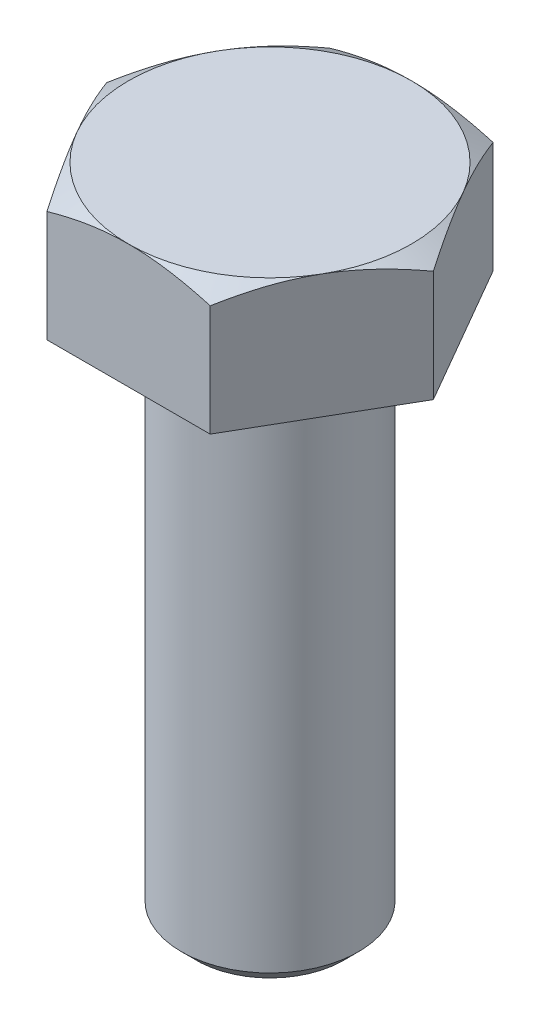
ISO-10303-21;
HEADER;
FILE_DESCRIPTION(('STEP AP214'),'2;1');
FILE_NAME('part.step','',(''),(''),'','','');
FILE_SCHEMA(('AUTOMOTIVE_DESIGN { 1 0 10303 214 1 1 1 1 }'));
ENDSEC;
DATA;
#1=APPLICATION_CONTEXT('core data for automotive mechanical design processes');
#2=APPLICATION_PROTOCOL_DEFINITION('international standard','automotive_design',2000,#1);
#3=PRODUCT_CONTEXT('',#1,'mechanical');
#4=PRODUCT('Part','Part','',(#3));
#5=PRODUCT_RELATED_PRODUCT_CATEGORY('part','',(#4));
#6=PRODUCT_DEFINITION_FORMATION('','',#4);
#7=PRODUCT_DEFINITION_CONTEXT('part definition',#1,'design');
#8=PRODUCT_DEFINITION('design','',#6,#7);
#9=PRODUCT_DEFINITION_SHAPE('','',#8);
#10=(LENGTH_UNIT() NAMED_UNIT(*) SI_UNIT(.MILLI.,.METRE.));
#11=(NAMED_UNIT(*) PLANE_ANGLE_UNIT() SI_UNIT($,.RADIAN.));
#12=(NAMED_UNIT(*) SI_UNIT($,.STERADIAN.) SOLID_ANGLE_UNIT());
#13=UNCERTAINTY_MEASURE_WITH_UNIT(LENGTH_MEASURE(1.E-05),#10,'distance_accuracy_value','');
#14=(GEOMETRIC_REPRESENTATION_CONTEXT(3) GLOBAL_UNCERTAINTY_ASSIGNED_CONTEXT((#13)) GLOBAL_UNIT_ASSIGNED_CONTEXT((#10,
#11,#12)) REPRESENTATION_CONTEXT('',''));
#15=CARTESIAN_POINT('',(0.,0.,0.));
#16=DIRECTION('',(0.,0.,1.));
#17=DIRECTION('',(1.,0.,0.));
#18=AXIS2_PLACEMENT_3D('',#15,#16,#17);
#19=CARTESIAN_POINT('',(0.,-18.,0.));
#20=DIRECTION('',(0.,1.,0.));
#21=DIRECTION('',(0.,0.,1.));
#22=AXIS2_PLACEMENT_3D('',#19,#20,#21);
#23=CYLINDRICAL_SURFACE('',#22,3.);
#24=CARTESIAN_POINT('',(0.,0.,0.));
#25=DIRECTION('',(0.,1.,0.));
#26=DIRECTION('',(0.,0.,1.));
#27=AXIS2_PLACEMENT_3D('',#24,#25,#26);
#28=CIRCLE('',#27,3.);
#29=CARTESIAN_POINT('',(0.,0.,3.));
#30=VERTEX_POINT('',#29);
#31=EDGE_CURVE('E13',#30,#30,#28,.F.);
#32=ORIENTED_EDGE('',*,*,#31,.T.);
#33=EDGE_LOOP('',(#32));
#34=FACE_BOUND('',#33,.T.);
#35=CARTESIAN_POINT('',(0.,-17.5,0.));
#36=DIRECTION('',(0.,1.,0.));
#37=DIRECTION('',(0.,0.,1.));
#38=AXIS2_PLACEMENT_3D('',#35,#36,#37);
#39=CIRCLE('',#38,3.);
#40=CARTESIAN_POINT('',(0.,-17.5,3.));
#41=VERTEX_POINT('',#40);
#42=EDGE_CURVE('E157',#41,#41,#39,.F.);
#43=ORIENTED_EDGE('',*,*,#42,.F.);
#44=EDGE_LOOP('',(#43));
#45=FACE_BOUND('',#44,.T.);
#46=ADVANCED_FACE('F62',(#34,#45),#23,.T.);
#47=CARTESIAN_POINT('',(2.7712812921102,4.2,4.8));
#48=DIRECTION('',(-0.866025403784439,0.,-0.5));
#49=DIRECTION('',(-0.5,0.,0.866025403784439));
#50=AXIS2_PLACEMENT_3D('',#47,#48,#49);
#51=PLANE('',#50);
#52=CARTESIAN_POINT('',(2.77116582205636,3.77121462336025,4.8002));
#53=CARTESIAN_POINT('',(2.89295517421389,3.84154644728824,4.58925465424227));
#54=CARTESIAN_POINT('',(3.01578619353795,3.90551651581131,4.37650508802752));
#55=CARTESIAN_POINT('',(3.26357516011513,4.01717683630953,3.94732200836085));
#56=CARTESIAN_POINT('',(3.38853750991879,4.06482758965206,3.73088086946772));
#57=CARTESIAN_POINT('',(3.63693257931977,4.13899002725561,3.30064798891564));
#58=CARTESIAN_POINT('',(3.76032661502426,4.1659956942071,3.08692324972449));
#59=CARTESIAN_POINT('',(3.94585172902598,4.19021248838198,2.7655843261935));
#60=CARTESIAN_POINT('',(4.00773575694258,4.19557080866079,2.65839804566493));
#61=CARTESIAN_POINT('',(4.13156100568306,4.20076582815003,2.44392642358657));
#62=CARTESIAN_POINT('',(4.19350222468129,4.20060269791,2.33664108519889));
#63=CARTESIAN_POINT('',(4.36320446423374,4.19255683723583,2.04270818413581));
#64=CARTESIAN_POINT('',(4.4709092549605,4.17904378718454,1.8561580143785));
#65=CARTESIAN_POINT('',(4.68560400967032,4.13619360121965,1.48429579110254));
#66=CARTESIAN_POINT('',(4.79259321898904,4.10684181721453,1.29898504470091));
#67=CARTESIAN_POINT('',(5.00772054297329,4.03346981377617,0.926373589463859));
#68=CARTESIAN_POINT('',(5.11583150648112,3.98913868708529,0.73911990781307));
#69=CARTESIAN_POINT('',(5.33044109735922,3.88852463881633,0.367405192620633));
#70=CARTESIAN_POINT('',(5.43694247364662,3.83226535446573,0.182939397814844));
#71=CARTESIAN_POINT('',(5.54267805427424,3.77121462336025,-0.000199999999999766));
#72=B_SPLINE_CURVE_WITH_KNOTS('',3,(#52,#53,#54,#55,#56,#57,#58,#59,#60,#61,#62,#63,#64,#65,#66,
#67,#68,#69,#70,#71),.UNSPECIFIED.,.F.,.F.,(4,2,2,2,2,2,2,2,2,4),(0.,0.760854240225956,
1.52353721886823,2.26734461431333,2.63888926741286,3.01042244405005,3.65724518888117,
4.30466716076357,4.96644900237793,5.62693149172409),.UNSPECIFIED.);
#73=CARTESIAN_POINT('',(2.7712812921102,3.7712812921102,4.8));
#74=VERTEX_POINT('',#73);
#75=CARTESIAN_POINT('',(4.1569219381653,4.2,2.4));
#76=VERTEX_POINT('',#75);
#77=EDGE_CURVE('E137',#74,#76,#72,.T.);
#78=ORIENTED_EDGE('',*,*,#77,.F.);
#79=DIRECTION('',(0.,-1.,0.));
#80=VECTOR('',#79,1.);
#81=CARTESIAN_POINT('',(2.7712812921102,4.2,4.8));
#82=LINE('',#81,#80);
#83=CARTESIAN_POINT('',(2.7712812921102,0.,4.8));
#84=VERTEX_POINT('',#83);
#85=EDGE_CURVE('E86',#74,#84,#82,.T.);
#86=ORIENTED_EDGE('',*,*,#85,.T.);
#87=DIRECTION('',(0.5,0.,-0.866025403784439));
#88=VECTOR('',#87,1.);
#89=CARTESIAN_POINT('',(2.7712812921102,0.,4.8));
#90=LINE('',#89,#88);
#91=CARTESIAN_POINT('',(5.5425625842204,0.,0.));
#92=VERTEX_POINT('',#91);
#93=EDGE_CURVE('E144',#84,#92,#90,.T.);
#94=ORIENTED_EDGE('',*,*,#93,.T.);
#95=DIRECTION('',(0.,-1.,0.));
#96=VECTOR('',#95,1.);
#97=CARTESIAN_POINT('',(5.5425625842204,4.2,0.));
#98=LINE('',#97,#96);
#99=CARTESIAN_POINT('',(5.5425625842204,3.77128129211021,0.));
#100=VERTEX_POINT('',#99);
#101=EDGE_CURVE('E160',#100,#92,#98,.T.);
#102=ORIENTED_EDGE('',*,*,#101,.F.);
#103=EDGE_CURVE('E145',#76,#100,#72,.T.);
#104=ORIENTED_EDGE('',*,*,#103,.F.);
#105=EDGE_LOOP('',(#78,#86,#94,#102,#104));
#106=FACE_BOUND('',#105,.T.);
#107=ADVANCED_FACE('F64',(#106),#51,.F.);
#108=CARTESIAN_POINT('',(5.5425625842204,4.2,0.));
#109=DIRECTION('',(-0.866025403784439,0.,0.5));
#110=DIRECTION('',(0.5,0.,0.866025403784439));
#111=AXIS2_PLACEMENT_3D('',#108,#109,#110);
#112=PLANE('',#111);
#113=CARTESIAN_POINT('',(5.54267805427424,3.77121462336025,0.000200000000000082));
#114=CARTESIAN_POINT('',(5.42088870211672,3.84154644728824,-0.210745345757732));
#115=CARTESIAN_POINT('',(5.29805768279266,3.90551651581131,-0.423494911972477));
#116=CARTESIAN_POINT('',(5.05026871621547,4.01717683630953,-0.852677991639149));
#117=CARTESIAN_POINT('',(4.92530636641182,4.06482758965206,-1.06911913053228));
#118=CARTESIAN_POINT('',(4.67691129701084,4.13899002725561,-1.49935201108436));
#119=CARTESIAN_POINT('',(4.55351726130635,4.1659956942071,-1.71307675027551));
#120=CARTESIAN_POINT('',(4.36799214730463,4.19021248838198,-2.0344156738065));
#121=CARTESIAN_POINT('',(4.30610811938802,4.1955708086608,-2.14160195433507));
#122=CARTESIAN_POINT('',(4.18228287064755,4.20076582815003,-2.35607357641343));
#123=CARTESIAN_POINT('',(4.12034165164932,4.20060269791,-2.46335891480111));
#124=CARTESIAN_POINT('',(3.95063941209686,4.19255683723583,-2.75729181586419));
#125=CARTESIAN_POINT('',(3.84293462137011,4.17904378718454,-2.9438419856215));
#126=CARTESIAN_POINT('',(3.62823986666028,4.13619360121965,-3.31570420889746));
#127=CARTESIAN_POINT('',(3.52125065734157,4.10684181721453,-3.50101495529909));
#128=CARTESIAN_POINT('',(3.30612333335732,4.03346981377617,-3.87362641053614));
#129=CARTESIAN_POINT('',(3.19801236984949,3.98913868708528,-4.06088009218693));
#130=CARTESIAN_POINT('',(2.98340277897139,3.88852463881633,-4.43259480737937));
#131=CARTESIAN_POINT('',(2.87690140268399,3.83226535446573,-4.61706060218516));
#132=CARTESIAN_POINT('',(2.77116582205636,3.77121462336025,-4.8002));
#133=B_SPLINE_CURVE_WITH_KNOTS('',3,(#113,#114,#115,#116,#117,#118,#119,#120,#121,#122,#123,
#124,#125,#126,#127,#128,#129,#130,#131,#132),.UNSPECIFIED.,.F.,.F.,(4,2,2,2,2,2,2,2,2,4),(0.,
0.760854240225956,1.52353721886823,2.26734461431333,2.63888926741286,3.01042244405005,
3.65724518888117,4.30466716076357,4.96644900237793,5.6269314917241),.UNSPECIFIED.);
#134=CARTESIAN_POINT('',(4.15692193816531,4.2,-2.4));
#135=VERTEX_POINT('',#134);
#136=EDGE_CURVE('E151',#100,#135,#133,.T.);
#137=ORIENTED_EDGE('',*,*,#136,.F.);
#138=ORIENTED_EDGE('',*,*,#101,.T.);
#139=DIRECTION('',(-0.5,0.,-0.866025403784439));
#140=VECTOR('',#139,1.);
#141=CARTESIAN_POINT('',(5.5425625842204,0.,0.));
#142=LINE('',#141,#140);
#143=CARTESIAN_POINT('',(2.7712812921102,0.,-4.8));
#144=VERTEX_POINT('',#143);
#145=EDGE_CURVE('E392',#92,#144,#142,.T.);
#146=ORIENTED_EDGE('',*,*,#145,.T.);
#147=DIRECTION('',(0.,-1.,0.));
#148=VECTOR('',#147,1.);
#149=CARTESIAN_POINT('',(2.7712812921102,4.2,-4.8));
#150=LINE('',#149,#148);
#151=CARTESIAN_POINT('',(2.7712812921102,3.7712812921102,-4.8));
#152=VERTEX_POINT('',#151);
#153=EDGE_CURVE('E366',#152,#144,#150,.T.);
#154=ORIENTED_EDGE('',*,*,#153,.F.);
#155=EDGE_CURVE('E161',#135,#152,#133,.T.);
#156=ORIENTED_EDGE('',*,*,#155,.F.);
#157=EDGE_LOOP('',(#137,#138,#146,#154,#156));
#158=FACE_BOUND('',#157,.T.);
#159=ADVANCED_FACE('F219',(#158),#112,.F.);
#160=CARTESIAN_POINT('',(2.7712812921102,4.2,-4.8));
#161=DIRECTION('',(0.,0.,1.));
#162=DIRECTION('',(1.,0.,0.));
#163=AXIS2_PLACEMENT_3D('',#160,#161,#162);
#164=PLANE('',#163);
#165=CARTESIAN_POINT('',(-7.58419451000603,1.78926088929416,-4.8));
#166=CARTESIAN_POINT('',(-7.37330579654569,1.89211671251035,-4.8));
#167=CARTESIAN_POINT('',(-7.1619477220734,1.99402596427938,-4.8));
#168=CARTESIAN_POINT('',(-6.73804371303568,2.19542153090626,-4.8));
#169=CARTESIAN_POINT('',(-6.52549760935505,2.29490748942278,-4.8));
#170=CARTESIAN_POINT('',(-6.09793932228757,2.49139749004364,-4.8));
#171=CARTESIAN_POINT('',(-5.88292008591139,2.58838623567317,-4.8));
#172=CARTESIAN_POINT('',(-5.4512194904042,2.77857685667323,-4.8));
#173=CARTESIAN_POINT('',(-5.23453820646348,2.8717789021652,-4.8));
#174=CARTESIAN_POINT('',(-4.79170856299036,3.05651314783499,-4.8));
#175=CARTESIAN_POINT('',(-4.56549027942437,3.14787861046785,-4.8));
#176=CARTESIAN_POINT('',(-4.11045944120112,3.32402796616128,-4.8));
#177=CARTESIAN_POINT('',(-3.88164660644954,3.40881114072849,-4.8));
#178=CARTESIAN_POINT('',(-3.4214472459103,3.56967266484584,-4.8));
#179=CARTESIAN_POINT('',(-3.19006653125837,3.64576747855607,-4.8));
#180=CARTESIAN_POINT('',(-2.72398888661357,3.78690387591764,-4.8));
#181=CARTESIAN_POINT('',(-2.48929298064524,3.85194879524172,-4.8));
#182=CARTESIAN_POINT('',(-2.01775666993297,3.96761086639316,-4.8));
#183=CARTESIAN_POINT('',(-1.78093666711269,4.01830970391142,-4.8));
#184=CARTESIAN_POINT('',(-1.30421047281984,4.10250821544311,-4.8));
#185=CARTESIAN_POINT('',(-1.06430462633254,4.13600979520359,-4.8));
#186=CARTESIAN_POINT('',(-0.585793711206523,4.1827103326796,-4.8));
#187=CARTESIAN_POINT('',(-0.34721584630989,4.19618113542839,-4.8));
#188=CARTESIAN_POINT('',(0.130236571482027,4.20240333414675,-4.8));
#189=CARTESIAN_POINT('',(0.369111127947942,4.19515447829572,-4.8));
#190=CARTESIAN_POINT('',(0.77055657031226,4.1660861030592,-4.8));
#191=CARTESIAN_POINT('',(0.933537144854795,4.14955585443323,-4.8));
#192=CARTESIAN_POINT('',(1.25838867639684,4.10780550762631,-4.8));
#193=CARTESIAN_POINT('',(1.42025949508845,4.08258434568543,-4.8));
#194=CARTESIAN_POINT('',(1.90394062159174,3.99520164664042,-4.8));
#195=CARTESIAN_POINT('',(2.22366418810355,3.92133371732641,-4.8));
#196=CARTESIAN_POINT('',(2.70203175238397,3.79215951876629,-4.8));
#197=CARTESIAN_POINT('',(2.86312371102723,3.74539296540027,-4.8));
#198=CARTESIAN_POINT('',(3.18374547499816,3.64673383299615,-4.8));
#199=CARTESIAN_POINT('',(3.34327526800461,3.59484121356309,-4.8));
#200=CARTESIAN_POINT('',(3.66082010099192,3.48678479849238,-4.8));
#201=CARTESIAN_POINT('',(3.81883553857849,3.43062216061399,-4.8));
#202=CARTESIAN_POINT('',(4.1335376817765,3.31471318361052,-4.8));
#203=CARTESIAN_POINT('',(4.29022441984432,3.25496693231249,-4.8));
#204=CARTESIAN_POINT('',(4.71813346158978,3.08708676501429,-4.8));
#205=CARTESIAN_POINT('',(4.988162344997,2.97591355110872,-4.8));
#206=CARTESIAN_POINT('',(5.52537424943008,2.74686696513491,-4.8));
#207=CARTESIAN_POINT('',(5.7925569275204,2.62899279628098,-4.8));
#208=CARTESIAN_POINT('',(6.32474350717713,2.38815719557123,-4.8));
#209=CARTESIAN_POINT('',(6.58974647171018,2.26519370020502,-4.8));
#210=CARTESIAN_POINT('',(7.1179116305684,2.01541789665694,-4.8));
#211=CARTESIAN_POINT('',(7.38107390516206,1.8886057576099,-4.8));
#212=CARTESIAN_POINT('',(7.90637212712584,1.63176885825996,-4.8));
#213=CARTESIAN_POINT('',(8.16850560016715,1.50173904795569,-4.8));
#214=CARTESIAN_POINT('',(8.69157892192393,1.23929908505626,-4.8));
#215=CARTESIAN_POINT('',(8.95251875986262,1.10688891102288,-4.8));
#216=CARTESIAN_POINT('',(9.73376272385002,0.706888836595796,-4.8));
#217=CARTESIAN_POINT('',(10.2526164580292,0.436467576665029,-4.8));
#218=CARTESIAN_POINT('',(11.2314809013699,-0.0797533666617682,-4.8));
#219=CARTESIAN_POINT('',(11.6917642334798,-0.325038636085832,-4.8));
#220=CARTESIAN_POINT('',(12.6107980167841,-0.818535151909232,-4.8));
#221=CARTESIAN_POINT('',(13.0695483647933,-1.06674659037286,-4.80000000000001));
#222=CARTESIAN_POINT('',(13.9842755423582,-1.56445913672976,-4.80000000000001));
#223=CARTESIAN_POINT('',(14.4402564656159,-1.81395273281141,-4.80000000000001));
#224=CARTESIAN_POINT('',(15.351262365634,-2.31459047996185,-4.80000000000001));
#225=CARTESIAN_POINT('',(15.8062874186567,-2.56573449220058,-4.80000000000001));
#226=CARTESIAN_POINT('',(16.2609785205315,-2.81747794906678,-4.80000000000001));
#227=B_SPLINE_CURVE_WITH_KNOTS('',3,(#165,#166,#167,#168,#169,#170,#171,#172,#173,#174,#175,
#176,#177,#178,#179,#180,#181,#182,#183,#184,#185,#186,#187,#188,#189,#190,#191,#192,#193,#194,
#195,#196,#197,#198,#199,#200,#201,#202,#203,#204,#205,#206,#207,#208,#209,#210,#211,#212,#213,
#214,#215,#216,#217,#218,#219,#220,#221,#222,#223,#224,#225,#226),.UNSPECIFIED.,.F.,.F.,(4,2,2,
2,2,2,2,2,2,2,2,2,2,2,2,2,2,2,2,2,2,2,2,2,2,2,2,2,2,2,4),(0.,0.703911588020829,1.40792606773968,
2.11554129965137,2.82312470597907,3.55496159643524,4.28687825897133,5.01738409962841,
5.7476690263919,6.47370800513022,7.19966650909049,7.91567986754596,8.63170192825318,
9.12291649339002,9.61419120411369,10.5972062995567,11.1003888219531,11.6035753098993,
12.1066258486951,12.6096640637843,13.4855842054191,14.3616087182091,15.2379919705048,
16.1143367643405,16.9921571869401,17.8699855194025,19.6252234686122,21.1898950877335,
22.7546699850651,24.313990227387,25.8731809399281),.UNSPECIFIED.);
#228=CARTESIAN_POINT('',(0.,4.2,-4.8));
#229=VERTEX_POINT('',#228);
#230=EDGE_CURVE('E213',#152,#229,#227,.F.);
#231=ORIENTED_EDGE('',*,*,#230,.F.);
#232=ORIENTED_EDGE('',*,*,#153,.T.);
#233=DIRECTION('',(-1.,0.,0.));
#234=VECTOR('',#233,1.);
#235=CARTESIAN_POINT('',(2.7712812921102,0.,-4.8));
#236=LINE('',#235,#234);
#237=CARTESIAN_POINT('',(-2.7712812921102,0.,-4.8));
#238=VERTEX_POINT('',#237);
#239=EDGE_CURVE('E387',#144,#238,#236,.T.);
#240=ORIENTED_EDGE('',*,*,#239,.T.);
#241=DIRECTION('',(0.,-1.,0.));
#242=VECTOR('',#241,1.);
#243=CARTESIAN_POINT('',(-2.7712812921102,4.2,-4.8));
#244=LINE('',#243,#242);
#245=CARTESIAN_POINT('',(-2.7712812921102,3.7712812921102,-4.8));
#246=VERTEX_POINT('',#245);
#247=EDGE_CURVE('E359',#246,#238,#244,.T.);
#248=ORIENTED_EDGE('',*,*,#247,.F.);
#249=EDGE_CURVE('E207',#229,#246,#227,.F.);
#250=ORIENTED_EDGE('',*,*,#249,.F.);
#251=EDGE_LOOP('',(#231,#232,#240,#248,#250));
#252=FACE_BOUND('',#251,.T.);
#253=ADVANCED_FACE('F215',(#252),#164,.F.);
#254=CARTESIAN_POINT('',(-2.7712812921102,4.2,-4.8));
#255=DIRECTION('',(0.866025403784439,0.,0.5));
#256=DIRECTION('',(0.5,0.,-0.866025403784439));
#257=AXIS2_PLACEMENT_3D('',#254,#255,#256);
#258=PLANE('',#257);
#259=CARTESIAN_POINT('',(-2.77116582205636,3.77121462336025,-4.8002));
#260=CARTESIAN_POINT('',(-2.89295517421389,3.84154644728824,-4.58925465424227));
#261=CARTESIAN_POINT('',(-3.01578619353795,3.90551651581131,-4.37650508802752));
#262=CARTESIAN_POINT('',(-3.26357516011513,4.01717683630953,-3.94732200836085));
#263=CARTESIAN_POINT('',(-3.38853750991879,4.06482758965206,-3.73088086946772));
#264=CARTESIAN_POINT('',(-3.63693257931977,4.13899002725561,-3.30064798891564));
#265=CARTESIAN_POINT('',(-3.76032661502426,4.1659956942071,-3.08692324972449));
#266=CARTESIAN_POINT('',(-3.94585172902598,4.19021248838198,-2.7655843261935));
#267=CARTESIAN_POINT('',(-4.00773575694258,4.19557080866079,-2.65839804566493));
#268=CARTESIAN_POINT('',(-4.13156100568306,4.20076582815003,-2.44392642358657));
#269=CARTESIAN_POINT('',(-4.19350222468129,4.20060269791,-2.33664108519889));
#270=CARTESIAN_POINT('',(-4.36320446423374,4.19255683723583,-2.04270818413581));
#271=CARTESIAN_POINT('',(-4.4709092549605,4.17904378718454,-1.8561580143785));
#272=CARTESIAN_POINT('',(-4.68560400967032,4.13619360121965,-1.48429579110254));
#273=CARTESIAN_POINT('',(-4.79259321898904,4.10684181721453,-1.29898504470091));
#274=CARTESIAN_POINT('',(-5.00772054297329,4.03346981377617,-0.926373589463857));
#275=CARTESIAN_POINT('',(-5.11583150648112,3.98913868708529,-0.739119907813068));
#276=CARTESIAN_POINT('',(-5.33044109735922,3.88852463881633,-0.36740519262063));
#277=CARTESIAN_POINT('',(-5.43694247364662,3.83226535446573,-0.182939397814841));
#278=CARTESIAN_POINT('',(-5.54267805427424,3.77121462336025,0.000200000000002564));
#279=B_SPLINE_CURVE_WITH_KNOTS('',3,(#259,#260,#261,#262,#263,#264,#265,#266,#267,#268,#269,
#270,#271,#272,#273,#274,#275,#276,#277,#278),.UNSPECIFIED.,.F.,.F.,(4,2,2,2,2,2,2,2,2,4),(0.,
0.760854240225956,1.52353721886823,2.26734461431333,2.63888926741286,3.01042244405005,
3.65724518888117,4.30466716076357,4.96644900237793,5.6269314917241),.UNSPECIFIED.);
#280=CARTESIAN_POINT('',(-4.1569219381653,4.2,-2.4));
#281=VERTEX_POINT('',#280);
#282=EDGE_CURVE('E214',#246,#281,#279,.T.);
#283=ORIENTED_EDGE('',*,*,#282,.F.);
#284=ORIENTED_EDGE('',*,*,#247,.T.);
#285=DIRECTION('',(-0.5,0.,0.866025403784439));
#286=VECTOR('',#285,1.);
#287=CARTESIAN_POINT('',(-2.7712812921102,0.,-4.8));
#288=LINE('',#287,#286);
#289=CARTESIAN_POINT('',(-5.54256258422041,0.,0.));
#290=VERTEX_POINT('',#289);
#291=EDGE_CURVE('E384',#238,#290,#288,.T.);
#292=ORIENTED_EDGE('',*,*,#291,.T.);
#293=DIRECTION('',(0.,-1.,0.));
#294=VECTOR('',#293,1.);
#295=CARTESIAN_POINT('',(-5.54256258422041,4.2,0.));
#296=LINE('',#295,#294);
#297=CARTESIAN_POINT('',(-5.54256258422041,3.77128129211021,0.));
#298=VERTEX_POINT('',#297);
#299=EDGE_CURVE('E357',#298,#290,#296,.T.);
#300=ORIENTED_EDGE('',*,*,#299,.F.);
#301=EDGE_CURVE('E201',#281,#298,#279,.T.);
#302=ORIENTED_EDGE('',*,*,#301,.F.);
#303=EDGE_LOOP('',(#283,#284,#292,#300,#302));
#304=FACE_BOUND('',#303,.T.);
#305=ADVANCED_FACE('F218',(#304),#258,.F.);
#306=CARTESIAN_POINT('',(-5.54256258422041,4.2,0.));
#307=DIRECTION('',(0.866025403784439,0.,-0.5));
#308=DIRECTION('',(-0.5,0.,-0.866025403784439));
#309=AXIS2_PLACEMENT_3D('',#306,#307,#308);
#310=PLANE('',#309);
#311=CARTESIAN_POINT('',(-5.54267805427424,3.77121462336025,-0.000199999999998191));
#312=CARTESIAN_POINT('',(-5.42088870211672,3.84154644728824,0.210745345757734));
#313=CARTESIAN_POINT('',(-5.29805768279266,3.90551651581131,0.423494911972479));
#314=CARTESIAN_POINT('',(-5.05026871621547,4.01717683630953,0.852677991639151));
#315=CARTESIAN_POINT('',(-4.92530636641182,4.06482758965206,1.06911913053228));
#316=CARTESIAN_POINT('',(-4.67691129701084,4.13899002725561,1.49935201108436));
#317=CARTESIAN_POINT('',(-4.55351726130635,4.1659956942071,1.71307675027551));
#318=CARTESIAN_POINT('',(-4.36799214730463,4.19021248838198,2.0344156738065));
#319=CARTESIAN_POINT('',(-4.30610811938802,4.19557080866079,2.14160195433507));
#320=CARTESIAN_POINT('',(-4.18228287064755,4.20076582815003,2.35607357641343));
#321=CARTESIAN_POINT('',(-4.12034165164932,4.20060269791,2.46335891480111));
#322=CARTESIAN_POINT('',(-3.95063941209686,4.19255683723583,2.75729181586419));
#323=CARTESIAN_POINT('',(-3.84293462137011,4.17904378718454,2.9438419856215));
#324=CARTESIAN_POINT('',(-3.62823986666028,4.13619360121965,3.31570420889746));
#325=CARTESIAN_POINT('',(-3.52125065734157,4.10684181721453,3.50101495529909));
#326=CARTESIAN_POINT('',(-3.30612333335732,4.03346981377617,3.87362641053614));
#327=CARTESIAN_POINT('',(-3.19801236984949,3.98913868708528,4.06088009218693));
#328=CARTESIAN_POINT('',(-2.98340277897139,3.88852463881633,4.43259480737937));
#329=CARTESIAN_POINT('',(-2.87690140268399,3.83226535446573,4.61706060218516));
#330=CARTESIAN_POINT('',(-2.77116582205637,3.77121462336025,4.8002));
#331=B_SPLINE_CURVE_WITH_KNOTS('',3,(#311,#312,#313,#314,#315,#316,#317,#318,#319,#320,#321,
#322,#323,#324,#325,#326,#327,#328,#329,#330),.UNSPECIFIED.,.F.,.F.,(4,2,2,2,2,2,2,2,2,4),(0.,
0.760854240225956,1.52353721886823,2.26734461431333,2.63888926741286,3.01042244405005,
3.65724518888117,4.30466716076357,4.96644900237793,5.62693149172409),.UNSPECIFIED.);
#332=CARTESIAN_POINT('',(-4.1569219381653,4.2,2.4));
#333=VERTEX_POINT('',#332);
#334=EDGE_CURVE('E382',#298,#333,#331,.T.);
#335=ORIENTED_EDGE('',*,*,#334,.F.);
#336=ORIENTED_EDGE('',*,*,#299,.T.);
#337=DIRECTION('',(0.5,0.,0.866025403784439));
#338=VECTOR('',#337,1.);
#339=CARTESIAN_POINT('',(-5.54256258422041,0.,0.));
#340=LINE('',#339,#338);
#341=CARTESIAN_POINT('',(-2.7712812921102,0.,4.8));
#342=VERTEX_POINT('',#341);
#343=EDGE_CURVE('E355',#290,#342,#340,.T.);
#344=ORIENTED_EDGE('',*,*,#343,.T.);
#345=DIRECTION('',(0.,-1.,0.));
#346=VECTOR('',#345,1.);
#347=CARTESIAN_POINT('',(-2.7712812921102,4.2,4.8));
#348=LINE('',#347,#346);
#349=CARTESIAN_POINT('',(-2.77128129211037,3.77128129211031,4.8));
#350=VERTEX_POINT('',#349);
#351=EDGE_CURVE('E350',#350,#342,#348,.T.);
#352=ORIENTED_EDGE('',*,*,#351,.F.);
#353=EDGE_CURVE('E194',#333,#350,#331,.T.);
#354=ORIENTED_EDGE('',*,*,#353,.F.);
#355=EDGE_LOOP('',(#335,#336,#344,#352,#354));
#356=FACE_BOUND('',#355,.T.);
#357=ADVANCED_FACE('F333',(#356),#310,.F.);
#358=CARTESIAN_POINT('',(-2.7712812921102,4.2,4.8));
#359=DIRECTION('',(0.,0.,-1.));
#360=DIRECTION('',(-1.,0.,0.));
#361=AXIS2_PLACEMENT_3D('',#358,#359,#360);
#362=PLANE('',#361);
#363=CARTESIAN_POINT('',(-7.58419451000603,1.78926088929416,4.8));
#364=CARTESIAN_POINT('',(-7.3733057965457,1.89211671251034,4.8));
#365=CARTESIAN_POINT('',(-7.16194772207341,1.99402596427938,4.8));
#366=CARTESIAN_POINT('',(-6.73804371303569,2.19542153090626,4.8));
#367=CARTESIAN_POINT('',(-6.52549760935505,2.29490748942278,4.8));
#368=CARTESIAN_POINT('',(-6.09793932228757,2.49139749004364,4.8));
#369=CARTESIAN_POINT('',(-5.8829200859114,2.58838623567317,4.8));
#370=CARTESIAN_POINT('',(-5.4512194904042,2.77857685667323,4.8));
#371=CARTESIAN_POINT('',(-5.23453820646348,2.8717789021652,4.8));
#372=CARTESIAN_POINT('',(-4.79170856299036,3.05651314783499,4.8));
#373=CARTESIAN_POINT('',(-4.56549027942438,3.14787861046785,4.8));
#374=CARTESIAN_POINT('',(-4.11045944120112,3.32402796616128,4.8));
#375=CARTESIAN_POINT('',(-3.88164660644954,3.40881114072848,4.8));
#376=CARTESIAN_POINT('',(-3.4214472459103,3.56967266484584,4.8));
#377=CARTESIAN_POINT('',(-3.19006653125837,3.64576747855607,4.8));
#378=CARTESIAN_POINT('',(-2.72398888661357,3.78690387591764,4.8));
#379=CARTESIAN_POINT('',(-2.48929298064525,3.85194879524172,4.8));
#380=CARTESIAN_POINT('',(-2.01775666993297,3.96761086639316,4.8));
#381=CARTESIAN_POINT('',(-1.78093666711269,4.01830970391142,4.8));
#382=CARTESIAN_POINT('',(-1.30421047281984,4.10250821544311,4.8));
#383=CARTESIAN_POINT('',(-1.06430462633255,4.13600979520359,4.8));
#384=CARTESIAN_POINT('',(-0.585793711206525,4.1827103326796,4.8));
#385=CARTESIAN_POINT('',(-0.347215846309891,4.19618113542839,4.8));
#386=CARTESIAN_POINT('',(0.130236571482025,4.20240333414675,4.8));
#387=CARTESIAN_POINT('',(0.36911112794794,4.19515447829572,4.8));
#388=CARTESIAN_POINT('',(0.770556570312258,4.16608610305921,4.8));
#389=CARTESIAN_POINT('',(0.933537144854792,4.14955585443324,4.8));
#390=CARTESIAN_POINT('',(1.25838867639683,4.10780550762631,4.8));
#391=CARTESIAN_POINT('',(1.42025949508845,4.08258434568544,4.8));
#392=CARTESIAN_POINT('',(1.90394062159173,3.99520164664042,4.8));
#393=CARTESIAN_POINT('',(2.22366418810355,3.92133371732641,4.8));
#394=CARTESIAN_POINT('',(2.70203175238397,3.7921595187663,4.8));
#395=CARTESIAN_POINT('',(2.86312371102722,3.74539296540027,4.8));
#396=CARTESIAN_POINT('',(3.18374547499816,3.64673383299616,4.8));
#397=CARTESIAN_POINT('',(3.3432752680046,3.59484121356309,4.8));
#398=CARTESIAN_POINT('',(3.66082010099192,3.48678479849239,4.8));
#399=CARTESIAN_POINT('',(3.81883553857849,3.43062216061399,4.8));
#400=CARTESIAN_POINT('',(4.1335376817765,3.31471318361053,4.8));
#401=CARTESIAN_POINT('',(4.29022441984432,3.25496693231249,4.8));
#402=CARTESIAN_POINT('',(4.71813346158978,3.08708676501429,4.8));
#403=CARTESIAN_POINT('',(4.988162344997,2.97591355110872,4.8));
#404=CARTESIAN_POINT('',(5.52537424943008,2.74686696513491,4.8));
#405=CARTESIAN_POINT('',(5.7925569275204,2.62899279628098,4.8));
#406=CARTESIAN_POINT('',(6.32474350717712,2.38815719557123,4.8));
#407=CARTESIAN_POINT('',(6.58974647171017,2.26519370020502,4.8));
#408=CARTESIAN_POINT('',(7.1179116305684,2.01541789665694,4.8));
#409=CARTESIAN_POINT('',(7.38107390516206,1.8886057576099,4.8));
#410=CARTESIAN_POINT('',(7.90637212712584,1.63176885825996,4.8));
#411=CARTESIAN_POINT('',(8.16850560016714,1.50173904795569,4.8));
#412=CARTESIAN_POINT('',(8.69157892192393,1.23929908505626,4.8));
#413=CARTESIAN_POINT('',(8.95251875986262,1.10688891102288,4.8));
#414=CARTESIAN_POINT('',(9.73376272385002,0.706888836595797,4.8));
#415=CARTESIAN_POINT('',(10.2526164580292,0.436467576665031,4.8));
#416=CARTESIAN_POINT('',(11.2314809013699,-0.0797533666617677,4.8));
#417=CARTESIAN_POINT('',(11.6917642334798,-0.325038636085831,4.8));
#418=CARTESIAN_POINT('',(12.6107980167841,-0.818535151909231,4.8));
#419=CARTESIAN_POINT('',(13.0695483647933,-1.06674659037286,4.8));
#420=CARTESIAN_POINT('',(13.9842755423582,-1.56445913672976,4.8));
#421=CARTESIAN_POINT('',(14.4402564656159,-1.81395273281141,4.8));
#422=CARTESIAN_POINT('',(15.351262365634,-2.31459047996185,4.8));
#423=CARTESIAN_POINT('',(15.8062874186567,-2.56573449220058,4.8));
#424=CARTESIAN_POINT('',(16.2609785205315,-2.81747794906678,4.8));
#425=B_SPLINE_CURVE_WITH_KNOTS('',3,(#363,#364,#365,#366,#367,#368,#369,#370,#371,#372,#373,
#374,#375,#376,#377,#378,#379,#380,#381,#382,#383,#384,#385,#386,#387,#388,#389,#390,#391,#392,
#393,#394,#395,#396,#397,#398,#399,#400,#401,#402,#403,#404,#405,#406,#407,#408,#409,#410,#411,
#412,#413,#414,#415,#416,#417,#418,#419,#420,#421,#422,#423,#424),.UNSPECIFIED.,.F.,.F.,(4,2,2,
2,2,2,2,2,2,2,2,2,2,2,2,2,2,2,2,2,2,2,2,2,2,2,2,2,2,2,4),(0.,0.703911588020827,1.40792606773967,
2.11554129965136,2.82312470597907,3.55496159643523,4.28687825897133,5.01738409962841,
5.7476690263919,6.47370800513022,7.19966650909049,7.91567986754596,8.63170192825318,
9.12291649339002,9.61419120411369,10.5972062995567,11.1003888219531,11.6035753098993,
12.1066258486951,12.6096640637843,13.4855842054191,14.3616087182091,15.2379919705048,
16.1143367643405,16.9921571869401,17.8699855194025,19.6252234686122,21.1898950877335,
22.7546699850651,24.313990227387,25.8731809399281),.UNSPECIFIED.);
#426=CARTESIAN_POINT('',(0.,4.2,4.8));
#427=VERTEX_POINT('',#426);
#428=EDGE_CURVE('E348',#350,#427,#425,.T.);
#429=ORIENTED_EDGE('',*,*,#428,.F.);
#430=ORIENTED_EDGE('',*,*,#351,.T.);
#431=DIRECTION('',(1.,0.,0.));
#432=VECTOR('',#431,1.);
#433=CARTESIAN_POINT('',(-2.7712812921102,0.,4.8));
#434=LINE('',#433,#432);
#435=EDGE_CURVE('E361',#342,#84,#434,.T.);
#436=ORIENTED_EDGE('',*,*,#435,.T.);
#437=ORIENTED_EDGE('',*,*,#85,.F.);
#438=EDGE_CURVE('E142',#427,#74,#425,.T.);
#439=ORIENTED_EDGE('',*,*,#438,.F.);
#440=EDGE_LOOP('',(#429,#430,#436,#437,#439));
#441=FACE_BOUND('',#440,.T.);
#442=ADVANCED_FACE('F265',(#441),#362,.F.);
#443=CARTESIAN_POINT('',(0.,0.,0.));
#444=DIRECTION('',(0.,1.,0.));
#445=DIRECTION('',(0.,0.,1.));
#446=AXIS2_PLACEMENT_3D('',#443,#444,#445);
#447=PLANE('',#446);
#448=ORIENTED_EDGE('',*,*,#31,.F.);
#449=EDGE_LOOP('',(#448));
#450=FACE_BOUND('',#449,.T.);
#451=ORIENTED_EDGE('',*,*,#93,.F.);
#452=ORIENTED_EDGE('',*,*,#435,.F.);
#453=ORIENTED_EDGE('',*,*,#343,.F.);
#454=ORIENTED_EDGE('',*,*,#291,.F.);
#455=ORIENTED_EDGE('',*,*,#239,.F.);
#456=ORIENTED_EDGE('',*,*,#145,.F.);
#457=EDGE_LOOP('',(#451,#452,#453,#454,#455,#456));
#458=FACE_BOUND('',#457,.T.);
#459=ADVANCED_FACE('F263',(#450,#458),#447,.F.);
#460=CARTESIAN_POINT('',(0.,4.2,0.));
#461=DIRECTION('',(0.,-1.,0.));
#462=DIRECTION('',(0.,0.,1.));
#463=AXIS2_PLACEMENT_3D('',#460,#461,#462);
#464=CONICAL_SURFACE('',#463,4.8,1.0471975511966);
#465=ORIENTED_EDGE('',*,*,#353,.T.);
#466=ORIENTED_EDGE('',*,*,#428,.T.);
#467=CARTESIAN_POINT('',(0.,4.2,0.));
#468=DIRECTION('',(0.,1.,0.));
#469=DIRECTION('',(0.,0.,1.));
#470=AXIS2_PLACEMENT_3D('',#467,#468,#469);
#471=CIRCLE('',#470,4.8);
#472=EDGE_CURVE('E78',#333,#427,#471,.T.);
#473=ORIENTED_EDGE('',*,*,#472,.F.);
#474=EDGE_LOOP('',(#465,#466,#473));
#475=FACE_BOUND('',#474,.T.);
#476=ADVANCED_FACE('F179',(#475),#464,.T.);
#477=ORIENTED_EDGE('',*,*,#301,.T.);
#478=ORIENTED_EDGE('',*,*,#334,.T.);
#479=EDGE_CURVE('E368',#281,#333,#471,.T.);
#480=ORIENTED_EDGE('',*,*,#479,.F.);
#481=EDGE_LOOP('',(#477,#478,#480));
#482=FACE_BOUND('',#481,.T.);
#483=ADVANCED_FACE('F303',(#482),#464,.T.);
#484=ORIENTED_EDGE('',*,*,#249,.T.);
#485=ORIENTED_EDGE('',*,*,#282,.T.);
#486=EDGE_CURVE('E369',#229,#281,#471,.T.);
#487=ORIENTED_EDGE('',*,*,#486,.F.);
#488=EDGE_LOOP('',(#484,#485,#487));
#489=FACE_BOUND('',#488,.T.);
#490=ADVANCED_FACE('F296',(#489),#464,.T.);
#491=ORIENTED_EDGE('',*,*,#155,.T.);
#492=ORIENTED_EDGE('',*,*,#230,.T.);
#493=EDGE_CURVE('E155',#135,#229,#471,.T.);
#494=ORIENTED_EDGE('',*,*,#493,.F.);
#495=EDGE_LOOP('',(#491,#492,#494));
#496=FACE_BOUND('',#495,.T.);
#497=ADVANCED_FACE('F290',(#496),#464,.T.);
#498=ORIENTED_EDGE('',*,*,#103,.T.);
#499=ORIENTED_EDGE('',*,*,#136,.T.);
#500=EDGE_CURVE('E71',#76,#135,#471,.T.);
#501=ORIENTED_EDGE('',*,*,#500,.F.);
#502=EDGE_LOOP('',(#498,#499,#501));
#503=FACE_BOUND('',#502,.T.);
#504=ADVANCED_FACE('F149',(#503),#464,.T.);
#505=ORIENTED_EDGE('',*,*,#77,.T.);
#506=CARTESIAN_POINT('',(0.,4.2,0.));
#507=DIRECTION('',(0.,1.,0.));
#508=DIRECTION('',(0.,0.,1.));
#509=AXIS2_PLACEMENT_3D('',#506,#507,#508);
#510=CIRCLE('',#509,4.8);
#511=EDGE_CURVE('E140',#427,#76,#510,.T.);
#512=ORIENTED_EDGE('',*,*,#511,.F.);
#513=ORIENTED_EDGE('',*,*,#438,.T.);
#514=EDGE_LOOP('',(#505,#512,#513));
#515=FACE_BOUND('',#514,.T.);
#516=ADVANCED_FACE('F139',(#515),#464,.T.);
#517=CARTESIAN_POINT('',(0.,4.2,0.));
#518=DIRECTION('',(0.,1.,0.));
#519=DIRECTION('',(0.,0.,1.));
#520=AXIS2_PLACEMENT_3D('',#517,#518,#519);
#521=PLANE('',#520);
#522=ORIENTED_EDGE('',*,*,#472,.T.);
#523=ORIENTED_EDGE('',*,*,#511,.T.);
#524=ORIENTED_EDGE('',*,*,#500,.T.);
#525=ORIENTED_EDGE('',*,*,#493,.T.);
#526=ORIENTED_EDGE('',*,*,#486,.T.);
#527=ORIENTED_EDGE('',*,*,#479,.T.);
#528=EDGE_LOOP('',(#522,#523,#524,#525,#526,#527));
#529=FACE_BOUND('',#528,.T.);
#530=ADVANCED_FACE('F156',(#529),#521,.T.);
#531=CARTESIAN_POINT('',(0.,-18.,0.));
#532=DIRECTION('',(0.,1.,0.));
#533=DIRECTION('',(0.,0.,-1.));
#534=AXIS2_PLACEMENT_3D('',#531,#532,#533);
#535=CONICAL_SURFACE('',#534,2.5,0.78539816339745);
#536=CARTESIAN_POINT('',(0.,-18.,0.));
#537=DIRECTION('',(0.,-1.,0.));
#538=DIRECTION('',(0.,0.,-1.));
#539=AXIS2_PLACEMENT_3D('',#536,#537,#538);
#540=CIRCLE('',#539,2.5);
#541=CARTESIAN_POINT('',(0.,-18.,-2.5));
#542=VERTEX_POINT('',#541);
#543=EDGE_CURVE('E237',#542,#542,#540,.T.);
#544=ORIENTED_EDGE('',*,*,#543,.F.);
#545=EDGE_LOOP('',(#544));
#546=FACE_BOUND('',#545,.T.);
#547=ORIENTED_EDGE('',*,*,#42,.T.);
#548=EDGE_LOOP('',(#547));
#549=FACE_BOUND('',#548,.T.);
#550=ADVANCED_FACE('F245',(#546,#549),#535,.T.);
#551=CARTESIAN_POINT('',(0.,-18.,0.));
#552=DIRECTION('',(0.,-1.,0.));
#553=DIRECTION('',(0.,0.,-1.));
#554=AXIS2_PLACEMENT_3D('',#551,#552,#553);
#555=PLANE('',#554);
#556=ORIENTED_EDGE('',*,*,#543,.T.);
#557=EDGE_LOOP('',(#556));
#558=FACE_BOUND('',#557,.T.);
#559=ADVANCED_FACE('F243',(#558),#555,.T.);
#560=CLOSED_SHELL('',(#46,#107,#159,#253,#305,#357,#442,#459,#476,#483,#490,#497,#504,#516,#530,
#550,#559));
#561=MANIFOLD_SOLID_BREP('B2',#560);
#562=ADVANCED_BREP_SHAPE_REPRESENTATION('',(#18,#561),#14);
#563=SHAPE_DEFINITION_REPRESENTATION(#9,#562);
ENDSEC;
END-ISO-10303-21;
